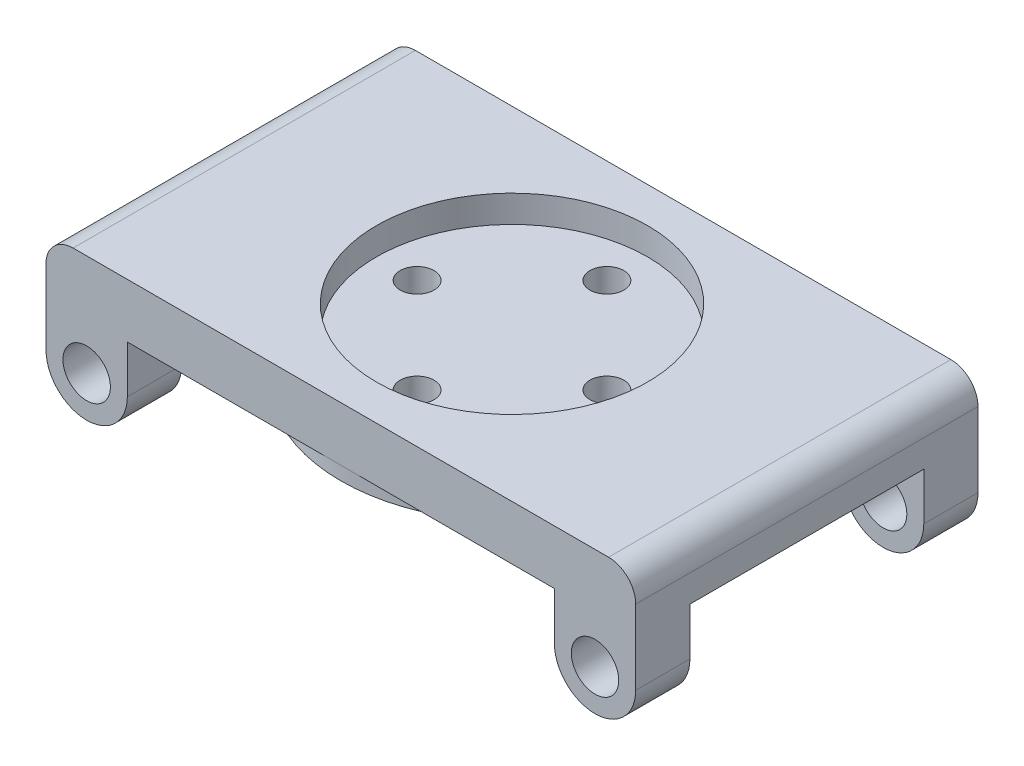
ISO-10303-21;
HEADER;
FILE_DESCRIPTION(('STEP AP214'),'2;1');
FILE_NAME('part.step','',(''),(''),'','','');
FILE_SCHEMA(('AUTOMOTIVE_DESIGN { 1 0 10303 214 1 1 1 1 }'));
ENDSEC;
DATA;
#1=APPLICATION_CONTEXT('core data for automotive mechanical design processes');
#2=APPLICATION_PROTOCOL_DEFINITION('international standard','automotive_design',2000,#1);
#3=PRODUCT_CONTEXT('',#1,'mechanical');
#4=PRODUCT('Part','Part','',(#3));
#5=PRODUCT_RELATED_PRODUCT_CATEGORY('part','',(#4));
#6=PRODUCT_DEFINITION_FORMATION('','',#4);
#7=PRODUCT_DEFINITION_CONTEXT('part definition',#1,'design');
#8=PRODUCT_DEFINITION('design','',#6,#7);
#9=PRODUCT_DEFINITION_SHAPE('','',#8);
#10=(LENGTH_UNIT() NAMED_UNIT(*) SI_UNIT(.MILLI.,.METRE.));
#11=(NAMED_UNIT(*) PLANE_ANGLE_UNIT() SI_UNIT($,.RADIAN.));
#12=(NAMED_UNIT(*) SI_UNIT($,.STERADIAN.) SOLID_ANGLE_UNIT());
#13=UNCERTAINTY_MEASURE_WITH_UNIT(LENGTH_MEASURE(1.E-05),#10,'distance_accuracy_value','');
#14=(GEOMETRIC_REPRESENTATION_CONTEXT(3) GLOBAL_UNCERTAINTY_ASSIGNED_CONTEXT((#13)) GLOBAL_UNIT_ASSIGNED_CONTEXT((#10,
#11,#12)) REPRESENTATION_CONTEXT('',''));
#15=CARTESIAN_POINT('',(0.,0.,0.));
#16=DIRECTION('',(0.,0.,1.));
#17=DIRECTION('',(1.,0.,0.));
#18=AXIS2_PLACEMENT_3D('',#15,#16,#17);
#19=CARTESIAN_POINT('',(0.,0.,0.));
#20=DIRECTION('',(0.,-1.,0.));
#21=DIRECTION('',(0.,0.,-1.));
#22=AXIS2_PLACEMENT_3D('',#19,#20,#21);
#23=PLANE('',#22);
#24=DIRECTION('',(1.,0.,0.));
#25=VECTOR('',#24,1.);
#26=CARTESIAN_POINT('',(0.,0.,-8.625));
#27=LINE('',#26,#25);
#28=CARTESIAN_POINT('',(-21.75,0.,-8.625));
#29=VERTEX_POINT('',#28);
#30=CARTESIAN_POINT('',(-15.75,0.,-8.625));
#31=VERTEX_POINT('',#30);
#32=EDGE_CURVE('E248',#29,#31,#27,.T.);
#33=ORIENTED_EDGE('',*,*,#32,.T.);
#34=DIRECTION('',(0.,0.,-1.));
#35=VECTOR('',#34,1.);
#36=CARTESIAN_POINT('',(-15.75,0.,-8.625));
#37=LINE('',#36,#35);
#38=CARTESIAN_POINT('',(-15.75,0.,-12.625));
#39=VERTEX_POINT('',#38);
#40=EDGE_CURVE('E258',#31,#39,#37,.T.);
#41=ORIENTED_EDGE('',*,*,#40,.T.);
#42=DIRECTION('',(-1.,0.,0.));
#43=VECTOR('',#42,1.);
#44=CARTESIAN_POINT('',(-21.75,0.,-12.625));
#45=LINE('',#44,#43);
#46=CARTESIAN_POINT('',(0.,0.,-12.625));
#47=VERTEX_POINT('',#46);
#48=EDGE_CURVE('E422',#47,#39,#45,.T.);
#49=ORIENTED_EDGE('',*,*,#48,.F.);
#50=CARTESIAN_POINT('',(0.,0.,0.));
#51=DIRECTION('',(0.,-1.,0.));
#52=DIRECTION('',(0.,0.,-1.));
#53=AXIS2_PLACEMENT_3D('',#50,#51,#52);
#54=CIRCLE('',#53,12.625);
#55=CARTESIAN_POINT('',(0.,0.,12.625));
#56=VERTEX_POINT('',#55);
#57=EDGE_CURVE('E400',#56,#47,#54,.T.);
#58=ORIENTED_EDGE('',*,*,#57,.F.);
#59=DIRECTION('',(1.,0.,0.));
#60=VECTOR('',#59,1.);
#61=CARTESIAN_POINT('',(-21.75,0.,12.625));
#62=LINE('',#61,#60);
#63=CARTESIAN_POINT('',(-15.75,0.,12.625));
#64=VERTEX_POINT('',#63);
#65=EDGE_CURVE('E414',#64,#56,#62,.T.);
#66=ORIENTED_EDGE('',*,*,#65,.F.);
#67=DIRECTION('',(0.,0.,1.));
#68=VECTOR('',#67,1.);
#69=CARTESIAN_POINT('',(-15.75,0.,8.625));
#70=LINE('',#69,#68);
#71=CARTESIAN_POINT('',(-15.75,0.,8.625));
#72=VERTEX_POINT('',#71);
#73=EDGE_CURVE('E349',#72,#64,#70,.T.);
#74=ORIENTED_EDGE('',*,*,#73,.F.);
#75=DIRECTION('',(1.,0.,0.));
#76=VECTOR('',#75,1.);
#77=CARTESIAN_POINT('',(0.,0.,8.625));
#78=LINE('',#77,#76);
#79=CARTESIAN_POINT('',(-21.75,0.,8.625));
#80=VERTEX_POINT('',#79);
#81=EDGE_CURVE('E336',#80,#72,#78,.T.);
#82=ORIENTED_EDGE('',*,*,#81,.F.);
#83=DIRECTION('',(0.,0.,1.));
#84=VECTOR('',#83,1.);
#85=CARTESIAN_POINT('',(-21.75,0.,12.625));
#86=LINE('',#85,#84);
#87=EDGE_CURVE('E426',#29,#80,#86,.T.);
#88=ORIENTED_EDGE('',*,*,#87,.F.);
#89=EDGE_LOOP('',(#33,#41,#49,#58,#66,#74,#82,#88));
#90=FACE_BOUND('',#89,.T.);
#91=ADVANCED_FACE('F53',(#90),#23,.T.);
#92=DIRECTION('',(0.,0.,-1.));
#93=VECTOR('',#92,1.);
#94=CARTESIAN_POINT('',(15.75,0.,-8.625));
#95=LINE('',#94,#93);
#96=CARTESIAN_POINT('',(15.75,0.,-8.625));
#97=VERTEX_POINT('',#96);
#98=CARTESIAN_POINT('',(15.75,0.,-12.625));
#99=VERTEX_POINT('',#98);
#100=EDGE_CURVE('E197',#97,#99,#95,.T.);
#101=ORIENTED_EDGE('',*,*,#100,.F.);
#102=DIRECTION('',(1.,0.,0.));
#103=VECTOR('',#102,1.);
#104=CARTESIAN_POINT('',(0.,0.,-8.625));
#105=LINE('',#104,#103);
#106=CARTESIAN_POINT('',(21.75,0.,-8.625));
#107=VERTEX_POINT('',#106);
#108=EDGE_CURVE('E207',#97,#107,#105,.T.);
#109=ORIENTED_EDGE('',*,*,#108,.T.);
#110=DIRECTION('',(0.,0.,-1.));
#111=VECTOR('',#110,1.);
#112=CARTESIAN_POINT('',(21.75,0.,12.625));
#113=LINE('',#112,#111);
#114=CARTESIAN_POINT('',(21.75,0.,8.625));
#115=VERTEX_POINT('',#114);
#116=EDGE_CURVE('E405',#115,#107,#113,.T.);
#117=ORIENTED_EDGE('',*,*,#116,.F.);
#118=DIRECTION('',(1.,0.,0.));
#119=VECTOR('',#118,1.);
#120=CARTESIAN_POINT('',(0.,0.,8.625));
#121=LINE('',#120,#119);
#122=CARTESIAN_POINT('',(15.75,0.,8.625));
#123=VERTEX_POINT('',#122);
#124=EDGE_CURVE('E287',#123,#115,#121,.T.);
#125=ORIENTED_EDGE('',*,*,#124,.F.);
#126=DIRECTION('',(0.,0.,1.));
#127=VECTOR('',#126,1.);
#128=CARTESIAN_POINT('',(15.75,0.,8.625));
#129=LINE('',#128,#127);
#130=CARTESIAN_POINT('',(15.75,0.,12.625));
#131=VERTEX_POINT('',#130);
#132=EDGE_CURVE('E312',#123,#131,#129,.T.);
#133=ORIENTED_EDGE('',*,*,#132,.T.);
#134=EDGE_CURVE('E429',#56,#131,#62,.T.);
#135=ORIENTED_EDGE('',*,*,#134,.F.);
#136=EDGE_CURVE('E391',#47,#56,#54,.T.);
#137=ORIENTED_EDGE('',*,*,#136,.F.);
#138=EDGE_CURVE('E423',#99,#47,#45,.T.);
#139=ORIENTED_EDGE('',*,*,#138,.F.);
#140=EDGE_LOOP('',(#101,#109,#117,#125,#133,#135,#137,#139));
#141=FACE_BOUND('',#140,.T.);
#142=ADVANCED_FACE('F482',(#141),#23,.T.);
#143=CARTESIAN_POINT('',(21.75,4.,12.625));
#144=DIRECTION('',(-1.,0.,0.));
#145=DIRECTION('',(0.,0.,1.));
#146=AXIS2_PLACEMENT_3D('',#143,#144,#145);
#147=PLANE('',#146);
#148=DIRECTION('',(0.,-1.,0.));
#149=VECTOR('',#148,1.);
#150=CARTESIAN_POINT('',(21.75,4.,-12.625));
#151=LINE('',#150,#149);
#152=CARTESIAN_POINT('',(21.75,2.,-12.625));
#153=VERTEX_POINT('',#152);
#154=CARTESIAN_POINT('',(21.75,-3.5,-12.625));
#155=VERTEX_POINT('',#154);
#156=EDGE_CURVE('E440',#153,#155,#151,.T.);
#157=ORIENTED_EDGE('',*,*,#156,.F.);
#158=DIRECTION('',(0.,0.,-1.));
#159=VECTOR('',#158,1.);
#160=CARTESIAN_POINT('',(21.75,2.,12.625));
#161=LINE('',#160,#159);
#162=CARTESIAN_POINT('',(21.75,2.,12.625));
#163=VERTEX_POINT('',#162);
#164=EDGE_CURVE('E77',#153,#163,#161,.F.);
#165=ORIENTED_EDGE('',*,*,#164,.T.);
#166=DIRECTION('',(0.,-1.,0.));
#167=VECTOR('',#166,1.);
#168=CARTESIAN_POINT('',(21.75,4.,12.625));
#169=LINE('',#168,#167);
#170=CARTESIAN_POINT('',(21.75,-3.5,12.625));
#171=VERTEX_POINT('',#170);
#172=EDGE_CURVE('E418',#163,#171,#169,.T.);
#173=ORIENTED_EDGE('',*,*,#172,.T.);
#174=DIRECTION('',(0.,0.,1.));
#175=VECTOR('',#174,1.);
#176=CARTESIAN_POINT('',(21.75,-3.5,8.625));
#177=LINE('',#176,#175);
#178=CARTESIAN_POINT('',(21.75,-3.5,8.625));
#179=VERTEX_POINT('',#178);
#180=EDGE_CURVE('E297',#179,#171,#177,.T.);
#181=ORIENTED_EDGE('',*,*,#180,.F.);
#182=DIRECTION('',(0.,-1.,0.));
#183=VECTOR('',#182,1.);
#184=CARTESIAN_POINT('',(21.75,0.,8.625));
#185=LINE('',#184,#183);
#186=EDGE_CURVE('E283',#115,#179,#185,.T.);
#187=ORIENTED_EDGE('',*,*,#186,.F.);
#188=ORIENTED_EDGE('',*,*,#116,.T.);
#189=DIRECTION('',(0.,-1.,0.));
#190=VECTOR('',#189,1.);
#191=CARTESIAN_POINT('',(21.75,0.,-8.625));
#192=LINE('',#191,#190);
#193=CARTESIAN_POINT('',(21.75,-3.5,-8.625));
#194=VERTEX_POINT('',#193);
#195=EDGE_CURVE('E223',#107,#194,#192,.T.);
#196=ORIENTED_EDGE('',*,*,#195,.T.);
#197=DIRECTION('',(0.,0.,-1.));
#198=VECTOR('',#197,1.);
#199=CARTESIAN_POINT('',(21.75,-3.5,-8.625));
#200=LINE('',#199,#198);
#201=EDGE_CURVE('E212',#194,#155,#200,.T.);
#202=ORIENTED_EDGE('',*,*,#201,.T.);
#203=EDGE_LOOP('',(#157,#165,#173,#181,#187,#188,#196,#202));
#204=FACE_BOUND('',#203,.T.);
#205=ADVANCED_FACE('F476',(#204),#147,.F.);
#206=CARTESIAN_POINT('',(-21.75,4.,-12.625));
#207=DIRECTION('',(0.,0.,1.));
#208=DIRECTION('',(1.,0.,0.));
#209=AXIS2_PLACEMENT_3D('',#206,#207,#208);
#210=PLANE('',#209);
#211=DIRECTION('',(-1.,0.,0.));
#212=VECTOR('',#211,1.);
#213=CARTESIAN_POINT('',(-21.75,4.,-12.625));
#214=LINE('',#213,#212);
#215=CARTESIAN_POINT('',(19.75,4.,-12.625));
#216=VERTEX_POINT('',#215);
#217=CARTESIAN_POINT('',(-19.75,4.,-12.625));
#218=VERTEX_POINT('',#217);
#219=EDGE_CURVE('E409',#216,#218,#214,.T.);
#220=ORIENTED_EDGE('',*,*,#219,.F.);
#221=CARTESIAN_POINT('',(19.75,2.,-12.625));
#222=DIRECTION('',(0.,0.,1.));
#223=DIRECTION('',(1.,0.,0.));
#224=AXIS2_PLACEMENT_3D('',#221,#222,#223);
#225=CIRCLE('',#224,2.);
#226=EDGE_CURVE('E454',#216,#153,#225,.F.);
#227=ORIENTED_EDGE('',*,*,#226,.T.);
#228=ORIENTED_EDGE('',*,*,#156,.T.);
#229=CARTESIAN_POINT('',(18.75,-3.5,-12.625));
#230=DIRECTION('',(0.,0.,1.));
#231=DIRECTION('',(1.,0.,0.));
#232=AXIS2_PLACEMENT_3D('',#229,#230,#231);
#233=CIRCLE('',#232,3.);
#234=CARTESIAN_POINT('',(15.75,-3.5,-12.625));
#235=VERTEX_POINT('',#234);
#236=EDGE_CURVE('E229',#155,#235,#233,.F.);
#237=ORIENTED_EDGE('',*,*,#236,.T.);
#238=DIRECTION('',(0.,1.,0.));
#239=VECTOR('',#238,1.);
#240=CARTESIAN_POINT('',(15.75,0.,-12.625));
#241=LINE('',#240,#239);
#242=EDGE_CURVE('E191',#235,#99,#241,.T.);
#243=ORIENTED_EDGE('',*,*,#242,.T.);
#244=ORIENTED_EDGE('',*,*,#138,.T.);
#245=ORIENTED_EDGE('',*,*,#48,.T.);
#246=DIRECTION('',(0.,1.,0.));
#247=VECTOR('',#246,1.);
#248=CARTESIAN_POINT('',(-15.75,0.,-12.625));
#249=LINE('',#248,#247);
#250=CARTESIAN_POINT('',(-15.75,-3.5,-12.625));
#251=VERTEX_POINT('',#250);
#252=EDGE_CURVE('E262',#251,#39,#249,.T.);
#253=ORIENTED_EDGE('',*,*,#252,.F.);
#254=CARTESIAN_POINT('',(-18.75,-3.5,-12.625));
#255=DIRECTION('',(0.,0.,1.));
#256=DIRECTION('',(1.,0.,0.));
#257=AXIS2_PLACEMENT_3D('',#254,#255,#256);
#258=CIRCLE('',#257,3.);
#259=CARTESIAN_POINT('',(-21.75,-3.5,-12.625));
#260=VERTEX_POINT('',#259);
#261=EDGE_CURVE('E244',#260,#251,#258,.T.);
#262=ORIENTED_EDGE('',*,*,#261,.F.);
#263=DIRECTION('',(0.,-1.,0.));
#264=VECTOR('',#263,1.);
#265=CARTESIAN_POINT('',(-21.75,4.,-12.625));
#266=LINE('',#265,#264);
#267=CARTESIAN_POINT('',(-21.75,2.,-12.625));
#268=VERTEX_POINT('',#267);
#269=EDGE_CURVE('E437',#268,#260,#266,.T.);
#270=ORIENTED_EDGE('',*,*,#269,.F.);
#271=CARTESIAN_POINT('',(-19.75,2.,-12.625));
#272=DIRECTION('',(0.,0.,1.));
#273=DIRECTION('',(1.,0.,0.));
#274=AXIS2_PLACEMENT_3D('',#271,#272,#273);
#275=CIRCLE('',#274,2.);
#276=EDGE_CURVE('E451',#268,#218,#275,.F.);
#277=ORIENTED_EDGE('',*,*,#276,.T.);
#278=EDGE_LOOP('',(#220,#227,#228,#237,#243,#244,#245,#253,#262,#270,#277));
#279=FACE_BOUND('',#278,.T.);
#280=CARTESIAN_POINT('',(-18.75,-3.5,-12.625));
#281=DIRECTION('',(0.,0.,1.));
#282=DIRECTION('',(1.,0.,0.));
#283=AXIS2_PLACEMENT_3D('',#280,#281,#282);
#284=CIRCLE('',#283,1.75);
#285=CARTESIAN_POINT('',(-17.,-3.5,-12.625));
#286=VERTEX_POINT('',#285);
#287=EDGE_CURVE('E236',#286,#286,#284,.T.);
#288=ORIENTED_EDGE('',*,*,#287,.T.);
#289=EDGE_LOOP('',(#288));
#290=FACE_BOUND('',#289,.T.);
#291=CARTESIAN_POINT('',(18.75,-3.5,-12.625));
#292=DIRECTION('',(0.,0.,1.));
#293=DIRECTION('',(1.,0.,0.));
#294=AXIS2_PLACEMENT_3D('',#291,#292,#293);
#295=CIRCLE('',#294,1.75);
#296=CARTESIAN_POINT('',(20.5,-3.5,-12.625));
#297=VERTEX_POINT('',#296);
#298=EDGE_CURVE('E214',#297,#297,#295,.F.);
#299=ORIENTED_EDGE('',*,*,#298,.F.);
#300=EDGE_LOOP('',(#299));
#301=FACE_BOUND('',#300,.T.);
#302=ADVANCED_FACE('F474',(#279,#290,#301),#210,.F.);
#303=CARTESIAN_POINT('',(-21.75,4.,12.625));
#304=DIRECTION('',(1.,0.,0.));
#305=DIRECTION('',(0.,0.,-1.));
#306=AXIS2_PLACEMENT_3D('',#303,#304,#305);
#307=PLANE('',#306);
#308=DIRECTION('',(0.,-1.,0.));
#309=VECTOR('',#308,1.);
#310=CARTESIAN_POINT('',(-21.75,4.,12.625));
#311=LINE('',#310,#309);
#312=CARTESIAN_POINT('',(-21.75,2.,12.625));
#313=VERTEX_POINT('',#312);
#314=CARTESIAN_POINT('',(-21.75,-3.5,12.625));
#315=VERTEX_POINT('',#314);
#316=EDGE_CURVE('E434',#313,#315,#311,.T.);
#317=ORIENTED_EDGE('',*,*,#316,.F.);
#318=DIRECTION('',(0.,0.,1.));
#319=VECTOR('',#318,1.);
#320=CARTESIAN_POINT('',(-21.75,2.,12.625));
#321=LINE('',#320,#319);
#322=EDGE_CURVE('E11',#313,#268,#321,.F.);
#323=ORIENTED_EDGE('',*,*,#322,.T.);
#324=ORIENTED_EDGE('',*,*,#269,.T.);
#325=DIRECTION('',(0.,0.,-1.));
#326=VECTOR('',#325,1.);
#327=CARTESIAN_POINT('',(-21.75,-3.5,-8.625));
#328=LINE('',#327,#326);
#329=CARTESIAN_POINT('',(-21.75,-3.5,-8.625));
#330=VERTEX_POINT('',#329);
#331=EDGE_CURVE('E267',#330,#260,#328,.T.);
#332=ORIENTED_EDGE('',*,*,#331,.F.);
#333=DIRECTION('',(0.,-1.,0.));
#334=VECTOR('',#333,1.);
#335=CARTESIAN_POINT('',(-21.75,0.,-8.625));
#336=LINE('',#335,#334);
#337=EDGE_CURVE('E243',#29,#330,#336,.T.);
#338=ORIENTED_EDGE('',*,*,#337,.F.);
#339=ORIENTED_EDGE('',*,*,#87,.T.);
#340=DIRECTION('',(0.,-1.,0.));
#341=VECTOR('',#340,1.);
#342=CARTESIAN_POINT('',(-21.75,0.,8.625));
#343=LINE('',#342,#341);
#344=CARTESIAN_POINT('',(-21.75,-3.5,8.625));
#345=VERTEX_POINT('',#344);
#346=EDGE_CURVE('E323',#80,#345,#343,.T.);
#347=ORIENTED_EDGE('',*,*,#346,.T.);
#348=DIRECTION('',(0.,0.,1.));
#349=VECTOR('',#348,1.);
#350=CARTESIAN_POINT('',(-21.75,-3.5,8.625));
#351=LINE('',#350,#349);
#352=EDGE_CURVE('E339',#345,#315,#351,.T.);
#353=ORIENTED_EDGE('',*,*,#352,.T.);
#354=EDGE_LOOP('',(#317,#323,#324,#332,#338,#339,#347,#353));
#355=FACE_BOUND('',#354,.T.);
#356=ADVANCED_FACE('F586',(#355),#307,.F.);
#357=CARTESIAN_POINT('',(-21.75,4.,12.625));
#358=DIRECTION('',(0.,0.,-1.));
#359=DIRECTION('',(-1.,0.,0.));
#360=AXIS2_PLACEMENT_3D('',#357,#358,#359);
#361=PLANE('',#360);
#362=ORIENTED_EDGE('',*,*,#172,.F.);
#363=CARTESIAN_POINT('',(19.75,2.,12.625));
#364=DIRECTION('',(0.,0.,-1.));
#365=DIRECTION('',(-1.,0.,0.));
#366=AXIS2_PLACEMENT_3D('',#363,#364,#365);
#367=CIRCLE('',#366,2.);
#368=CARTESIAN_POINT('',(19.75,4.,12.625));
#369=VERTEX_POINT('',#368);
#370=EDGE_CURVE('E62',#163,#369,#367,.F.);
#371=ORIENTED_EDGE('',*,*,#370,.T.);
#372=DIRECTION('',(1.,0.,0.));
#373=VECTOR('',#372,1.);
#374=CARTESIAN_POINT('',(-21.75,4.,12.625));
#375=LINE('',#374,#373);
#376=CARTESIAN_POINT('',(-19.75,4.,12.625));
#377=VERTEX_POINT('',#376);
#378=EDGE_CURVE('E413',#377,#369,#375,.T.);
#379=ORIENTED_EDGE('',*,*,#378,.F.);
#380=CARTESIAN_POINT('',(-19.75,2.,12.625));
#381=DIRECTION('',(0.,0.,-1.));
#382=DIRECTION('',(-1.,0.,0.));
#383=AXIS2_PLACEMENT_3D('',#380,#381,#382);
#384=CIRCLE('',#383,2.);
#385=EDGE_CURVE('E69',#377,#313,#384,.F.);
#386=ORIENTED_EDGE('',*,*,#385,.T.);
#387=ORIENTED_EDGE('',*,*,#316,.T.);
#388=CARTESIAN_POINT('',(-18.75,-3.5,12.625));
#389=DIRECTION('',(0.,0.,1.));
#390=DIRECTION('',(1.,0.,0.));
#391=AXIS2_PLACEMENT_3D('',#388,#389,#390);
#392=CIRCLE('',#391,3.);
#393=CARTESIAN_POINT('',(-15.75,-3.5,12.625));
#394=VERTEX_POINT('',#393);
#395=EDGE_CURVE('E343',#315,#394,#392,.T.);
#396=ORIENTED_EDGE('',*,*,#395,.T.);
#397=DIRECTION('',(0.,1.,0.));
#398=VECTOR('',#397,1.);
#399=CARTESIAN_POINT('',(-15.75,0.,12.625));
#400=LINE('',#399,#398);
#401=EDGE_CURVE('E324',#394,#64,#400,.T.);
#402=ORIENTED_EDGE('',*,*,#401,.T.);
#403=ORIENTED_EDGE('',*,*,#65,.T.);
#404=ORIENTED_EDGE('',*,*,#134,.T.);
#405=DIRECTION('',(0.,1.,0.));
#406=VECTOR('',#405,1.);
#407=CARTESIAN_POINT('',(15.75,0.,12.625));
#408=LINE('',#407,#406);
#409=CARTESIAN_POINT('',(15.75,-3.5,12.625));
#410=VERTEX_POINT('',#409);
#411=EDGE_CURVE('E301',#410,#131,#408,.T.);
#412=ORIENTED_EDGE('',*,*,#411,.F.);
#413=CARTESIAN_POINT('',(18.75,-3.5,12.625));
#414=DIRECTION('',(0.,0.,1.));
#415=DIRECTION('',(1.,0.,0.));
#416=AXIS2_PLACEMENT_3D('',#413,#414,#415);
#417=CIRCLE('',#416,3.);
#418=EDGE_CURVE('E271',#171,#410,#417,.F.);
#419=ORIENTED_EDGE('',*,*,#418,.F.);
#420=EDGE_LOOP('',(#362,#371,#379,#386,#387,#396,#402,#403,#404,#412,#419));
#421=FACE_BOUND('',#420,.T.);
#422=CARTESIAN_POINT('',(-18.75,-3.5,12.625));
#423=DIRECTION('',(0.,0.,1.));
#424=DIRECTION('',(1.,0.,0.));
#425=AXIS2_PLACEMENT_3D('',#422,#423,#424);
#426=CIRCLE('',#425,1.75);
#427=CARTESIAN_POINT('',(-17.,-3.5,12.625));
#428=VERTEX_POINT('',#427);
#429=EDGE_CURVE('E311',#428,#428,#426,.T.);
#430=ORIENTED_EDGE('',*,*,#429,.F.);
#431=EDGE_LOOP('',(#430));
#432=FACE_BOUND('',#431,.T.);
#433=CARTESIAN_POINT('',(18.75,-3.5,12.625));
#434=DIRECTION('',(0.,0.,1.));
#435=DIRECTION('',(1.,0.,0.));
#436=AXIS2_PLACEMENT_3D('',#433,#434,#435);
#437=CIRCLE('',#436,1.75);
#438=CARTESIAN_POINT('',(20.5,-3.5,12.625));
#439=VERTEX_POINT('',#438);
#440=EDGE_CURVE('E284',#439,#439,#437,.F.);
#441=ORIENTED_EDGE('',*,*,#440,.T.);
#442=EDGE_LOOP('',(#441));
#443=FACE_BOUND('',#442,.T.);
#444=ADVANCED_FACE('F463',(#421,#432,#443),#361,.F.);
#445=CARTESIAN_POINT('',(0.,4.,0.));
#446=DIRECTION('',(0.,-1.,0.));
#447=DIRECTION('',(0.,0.,-1.));
#448=AXIS2_PLACEMENT_3D('',#445,#446,#447);
#449=PLANE('',#448);
#450=CARTESIAN_POINT('',(0.,4.,0.));
#451=DIRECTION('',(0.,1.,0.));
#452=DIRECTION('',(0.,0.,1.));
#453=AXIS2_PLACEMENT_3D('',#450,#451,#452);
#454=CIRCLE('',#453,10.);
#455=CARTESIAN_POINT('',(0.,4.,10.));
#456=VERTEX_POINT('',#455);
#457=EDGE_CURVE('E396',#456,#456,#454,.T.);
#458=ORIENTED_EDGE('',*,*,#457,.F.);
#459=EDGE_LOOP('',(#458));
#460=FACE_BOUND('',#459,.T.);
#461=ORIENTED_EDGE('',*,*,#378,.T.);
#462=DIRECTION('',(0.,0.,-1.));
#463=VECTOR('',#462,1.);
#464=CARTESIAN_POINT('',(19.75,4.,0.));
#465=LINE('',#464,#463);
#466=EDGE_CURVE('E447',#369,#216,#465,.T.);
#467=ORIENTED_EDGE('',*,*,#466,.T.);
#468=ORIENTED_EDGE('',*,*,#219,.T.);
#469=DIRECTION('',(0.,0.,1.));
#470=VECTOR('',#469,1.);
#471=CARTESIAN_POINT('',(-19.75,4.,0.));
#472=LINE('',#471,#470);
#473=EDGE_CURVE('E443',#218,#377,#472,.T.);
#474=ORIENTED_EDGE('',*,*,#473,.T.);
#475=EDGE_LOOP('',(#461,#467,#468,#474));
#476=FACE_BOUND('',#475,.T.);
#477=ADVANCED_FACE('F469',(#460,#476),#449,.F.);
#478=CARTESIAN_POINT('',(0.,2.,0.));
#479=DIRECTION('',(0.,1.,0.));
#480=DIRECTION('',(0.,0.,1.));
#481=AXIS2_PLACEMENT_3D('',#478,#479,#480);
#482=CYLINDRICAL_SURFACE('',#481,10.);
#483=CARTESIAN_POINT('',(0.,2.,0.));
#484=DIRECTION('',(0.,1.,0.));
#485=DIRECTION('',(0.,0.,1.));
#486=AXIS2_PLACEMENT_3D('',#483,#484,#485);
#487=CIRCLE('',#486,10.);
#488=CARTESIAN_POINT('',(0.,2.,10.));
#489=VERTEX_POINT('',#488);
#490=EDGE_CURVE('E401',#489,#489,#487,.T.);
#491=ORIENTED_EDGE('',*,*,#490,.F.);
#492=EDGE_LOOP('',(#491));
#493=FACE_BOUND('',#492,.T.);
#494=ORIENTED_EDGE('',*,*,#457,.T.);
#495=EDGE_LOOP('',(#494));
#496=FACE_BOUND('',#495,.T.);
#497=ADVANCED_FACE('F626',(#493,#496),#482,.F.);
#498=CARTESIAN_POINT('',(0.,2.,0.));
#499=DIRECTION('',(0.,1.,0.));
#500=DIRECTION('',(0.,0.,1.));
#501=AXIS2_PLACEMENT_3D('',#498,#499,#500);
#502=PLANE('',#501);
#503=CARTESIAN_POINT('',(0.,2.,-7.));
#504=DIRECTION('',(0.,1.,0.));
#505=DIRECTION('',(0.,0.,1.));
#506=AXIS2_PLACEMENT_3D('',#503,#504,#505);
#507=CIRCLE('',#506,1.25);
#508=CARTESIAN_POINT('',(0.,2.,-5.75));
#509=VERTEX_POINT('',#508);
#510=EDGE_CURVE('E387',#509,#509,#507,.T.);
#511=ORIENTED_EDGE('',*,*,#510,.F.);
#512=EDGE_LOOP('',(#511));
#513=FACE_BOUND('',#512,.T.);
#514=CARTESIAN_POINT('',(7.,2.,0.));
#515=DIRECTION('',(0.,1.,0.));
#516=DIRECTION('',(0.,0.,1.));
#517=AXIS2_PLACEMENT_3D('',#514,#515,#516);
#518=CIRCLE('',#517,1.25);
#519=CARTESIAN_POINT('',(7.,2.,1.25000000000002));
#520=VERTEX_POINT('',#519);
#521=EDGE_CURVE('E383',#520,#520,#518,.T.);
#522=ORIENTED_EDGE('',*,*,#521,.F.);
#523=EDGE_LOOP('',(#522));
#524=FACE_BOUND('',#523,.T.);
#525=CARTESIAN_POINT('',(0.,2.,7.));
#526=DIRECTION('',(0.,1.,0.));
#527=DIRECTION('',(0.,0.,1.));
#528=AXIS2_PLACEMENT_3D('',#525,#526,#527);
#529=CIRCLE('',#528,1.25);
#530=CARTESIAN_POINT('',(0.,2.,8.25));
#531=VERTEX_POINT('',#530);
#532=EDGE_CURVE('E379',#531,#531,#529,.T.);
#533=ORIENTED_EDGE('',*,*,#532,.F.);
#534=EDGE_LOOP('',(#533));
#535=FACE_BOUND('',#534,.T.);
#536=CARTESIAN_POINT('',(-7.,2.,0.));
#537=DIRECTION('',(0.,1.,0.));
#538=DIRECTION('',(0.,0.,1.));
#539=AXIS2_PLACEMENT_3D('',#536,#537,#538);
#540=CIRCLE('',#539,1.25);
#541=CARTESIAN_POINT('',(-7.,2.,1.24999999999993));
#542=VERTEX_POINT('',#541);
#543=EDGE_CURVE('E364',#542,#542,#540,.T.);
#544=ORIENTED_EDGE('',*,*,#543,.F.);
#545=EDGE_LOOP('',(#544));
#546=FACE_BOUND('',#545,.T.);
#547=ORIENTED_EDGE('',*,*,#490,.T.);
#548=EDGE_LOOP('',(#547));
#549=FACE_BOUND('',#548,.T.);
#550=ADVANCED_FACE('F638',(#513,#524,#535,#546,#549),#502,.T.);
#551=CARTESIAN_POINT('',(0.,-1.,0.));
#552=DIRECTION('',(0.,1.,0.));
#553=DIRECTION('',(0.,0.,1.));
#554=AXIS2_PLACEMENT_3D('',#551,#552,#553);
#555=CYLINDRICAL_SURFACE('',#554,12.625);
#556=CARTESIAN_POINT('',(0.,-1.,0.));
#557=DIRECTION('',(0.,-1.,0.));
#558=DIRECTION('',(0.,0.,-1.));
#559=AXIS2_PLACEMENT_3D('',#556,#557,#558);
#560=CIRCLE('',#559,12.625);
#561=CARTESIAN_POINT('',(0.,-1.,-12.625));
#562=VERTEX_POINT('',#561);
#563=EDGE_CURVE('E392',#562,#562,#560,.T.);
#564=ORIENTED_EDGE('',*,*,#563,.F.);
#565=EDGE_LOOP('',(#564));
#566=FACE_BOUND('',#565,.T.);
#567=ORIENTED_EDGE('',*,*,#136,.T.);
#568=ORIENTED_EDGE('',*,*,#57,.T.);
#569=EDGE_LOOP('',(#567,#568));
#570=FACE_BOUND('',#569,.T.);
#571=ADVANCED_FACE('F488',(#566,#570),#555,.T.);
#572=CARTESIAN_POINT('',(0.,-1.,0.));
#573=DIRECTION('',(0.,-1.,0.));
#574=DIRECTION('',(0.,0.,-1.));
#575=AXIS2_PLACEMENT_3D('',#572,#573,#574);
#576=PLANE('',#575);
#577=CARTESIAN_POINT('',(0.,-1.,-7.));
#578=DIRECTION('',(0.,1.,0.));
#579=DIRECTION('',(0.,0.,1.));
#580=AXIS2_PLACEMENT_3D('',#577,#578,#579);
#581=CIRCLE('',#580,1.25);
#582=CARTESIAN_POINT('',(0.,-1.,-5.75));
#583=VERTEX_POINT('',#582);
#584=EDGE_CURVE('E360',#583,#583,#581,.T.);
#585=ORIENTED_EDGE('',*,*,#584,.T.);
#586=EDGE_LOOP('',(#585));
#587=FACE_BOUND('',#586,.T.);
#588=CARTESIAN_POINT('',(7.,-1.,0.));
#589=DIRECTION('',(0.,1.,0.));
#590=DIRECTION('',(0.,0.,1.));
#591=AXIS2_PLACEMENT_3D('',#588,#589,#590);
#592=CIRCLE('',#591,1.25);
#593=CARTESIAN_POINT('',(7.,-1.,1.25000000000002));
#594=VERTEX_POINT('',#593);
#595=EDGE_CURVE('E365',#594,#594,#592,.T.);
#596=ORIENTED_EDGE('',*,*,#595,.T.);
#597=EDGE_LOOP('',(#596));
#598=FACE_BOUND('',#597,.T.);
#599=CARTESIAN_POINT('',(0.,-1.,7.));
#600=DIRECTION('',(0.,1.,0.));
#601=DIRECTION('',(0.,0.,1.));
#602=AXIS2_PLACEMENT_3D('',#599,#600,#601);
#603=CIRCLE('',#602,1.25);
#604=CARTESIAN_POINT('',(0.,-1.,8.25));
#605=VERTEX_POINT('',#604);
#606=EDGE_CURVE('E369',#605,#605,#603,.T.);
#607=ORIENTED_EDGE('',*,*,#606,.T.);
#608=EDGE_LOOP('',(#607));
#609=FACE_BOUND('',#608,.T.);
#610=CARTESIAN_POINT('',(-7.,-1.,0.));
#611=DIRECTION('',(0.,1.,0.));
#612=DIRECTION('',(0.,0.,1.));
#613=AXIS2_PLACEMENT_3D('',#610,#611,#612);
#614=CIRCLE('',#613,1.25);
#615=CARTESIAN_POINT('',(-7.,-1.,1.24999999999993));
#616=VERTEX_POINT('',#615);
#617=EDGE_CURVE('E353',#616,#616,#614,.T.);
#618=ORIENTED_EDGE('',*,*,#617,.T.);
#619=EDGE_LOOP('',(#618));
#620=FACE_BOUND('',#619,.T.);
#621=ORIENTED_EDGE('',*,*,#563,.T.);
#622=EDGE_LOOP('',(#621));
#623=FACE_BOUND('',#622,.T.);
#624=ADVANCED_FACE('F645',(#587,#598,#609,#620,#623),#576,.T.);
#625=CARTESIAN_POINT('',(-7.,-1.,0.));
#626=DIRECTION('',(0.,1.,0.));
#627=DIRECTION('',(0.,0.,1.));
#628=AXIS2_PLACEMENT_3D('',#625,#626,#627);
#629=CYLINDRICAL_SURFACE('',#628,1.25);
#630=ORIENTED_EDGE('',*,*,#543,.T.);
#631=EDGE_LOOP('',(#630));
#632=FACE_BOUND('',#631,.T.);
#633=ORIENTED_EDGE('',*,*,#617,.F.);
#634=EDGE_LOOP('',(#633));
#635=FACE_BOUND('',#634,.T.);
#636=ADVANCED_FACE('F649',(#632,#635),#629,.F.);
#637=CARTESIAN_POINT('',(0.,-1.,7.));
#638=DIRECTION('',(0.,1.,0.));
#639=DIRECTION('',(0.,0.,1.));
#640=AXIS2_PLACEMENT_3D('',#637,#638,#639);
#641=CYLINDRICAL_SURFACE('',#640,1.25);
#642=ORIENTED_EDGE('',*,*,#532,.T.);
#643=EDGE_LOOP('',(#642));
#644=FACE_BOUND('',#643,.T.);
#645=ORIENTED_EDGE('',*,*,#606,.F.);
#646=EDGE_LOOP('',(#645));
#647=FACE_BOUND('',#646,.T.);
#648=ADVANCED_FACE('F653',(#644,#647),#641,.F.);
#649=CARTESIAN_POINT('',(7.,-1.,0.));
#650=DIRECTION('',(0.,1.,0.));
#651=DIRECTION('',(0.,0.,1.));
#652=AXIS2_PLACEMENT_3D('',#649,#650,#651);
#653=CYLINDRICAL_SURFACE('',#652,1.25);
#654=ORIENTED_EDGE('',*,*,#521,.T.);
#655=EDGE_LOOP('',(#654));
#656=FACE_BOUND('',#655,.T.);
#657=ORIENTED_EDGE('',*,*,#595,.F.);
#658=EDGE_LOOP('',(#657));
#659=FACE_BOUND('',#658,.T.);
#660=ADVANCED_FACE('F657',(#656,#659),#653,.F.);
#661=CARTESIAN_POINT('',(0.,-1.,-7.));
#662=DIRECTION('',(0.,1.,0.));
#663=DIRECTION('',(0.,0.,1.));
#664=AXIS2_PLACEMENT_3D('',#661,#662,#663);
#665=CYLINDRICAL_SURFACE('',#664,1.25);
#666=ORIENTED_EDGE('',*,*,#510,.T.);
#667=EDGE_LOOP('',(#666));
#668=FACE_BOUND('',#667,.T.);
#669=ORIENTED_EDGE('',*,*,#584,.F.);
#670=EDGE_LOOP('',(#669));
#671=FACE_BOUND('',#670,.T.);
#672=ADVANCED_FACE('F661',(#668,#671),#665,.F.);
#673=CARTESIAN_POINT('',(-15.75,0.,8.625));
#674=DIRECTION('',(1.,0.,0.));
#675=DIRECTION('',(0.,1.,0.));
#676=AXIS2_PLACEMENT_3D('',#673,#674,#675);
#677=PLANE('',#676);
#678=ORIENTED_EDGE('',*,*,#401,.F.);
#679=DIRECTION('',(0.,0.,1.));
#680=VECTOR('',#679,1.);
#681=CARTESIAN_POINT('',(-15.75,-3.5,8.625));
#682=LINE('',#681,#680);
#683=CARTESIAN_POINT('',(-15.75,-3.5,8.625));
#684=VERTEX_POINT('',#683);
#685=EDGE_CURVE('E354',#684,#394,#682,.T.);
#686=ORIENTED_EDGE('',*,*,#685,.F.);
#687=DIRECTION('',(0.,1.,0.));
#688=VECTOR('',#687,1.);
#689=CARTESIAN_POINT('',(-15.75,0.,8.625));
#690=LINE('',#689,#688);
#691=EDGE_CURVE('E332',#684,#72,#690,.T.);
#692=ORIENTED_EDGE('',*,*,#691,.T.);
#693=ORIENTED_EDGE('',*,*,#73,.T.);
#694=EDGE_LOOP('',(#678,#686,#692,#693));
#695=FACE_BOUND('',#694,.T.);
#696=ADVANCED_FACE('F594',(#695),#677,.T.);
#697=CARTESIAN_POINT('',(-18.75,-3.5,8.625));
#698=DIRECTION('',(0.,0.,1.));
#699=DIRECTION('',(1.,0.,0.));
#700=AXIS2_PLACEMENT_3D('',#697,#698,#699);
#701=CYLINDRICAL_SURFACE('',#700,1.75);
#702=CARTESIAN_POINT('',(-18.75,-3.5,8.625));
#703=DIRECTION('',(0.,0.,1.));
#704=DIRECTION('',(1.,0.,0.));
#705=AXIS2_PLACEMENT_3D('',#702,#703,#704);
#706=CIRCLE('',#705,1.75);
#707=CARTESIAN_POINT('',(-17.,-3.5,8.625));
#708=VERTEX_POINT('',#707);
#709=EDGE_CURVE('E319',#708,#708,#706,.T.);
#710=ORIENTED_EDGE('',*,*,#709,.F.);
#711=EDGE_LOOP('',(#710));
#712=FACE_BOUND('',#711,.T.);
#713=ORIENTED_EDGE('',*,*,#429,.T.);
#714=EDGE_LOOP('',(#713));
#715=FACE_BOUND('',#714,.T.);
#716=ADVANCED_FACE('F666',(#712,#715),#701,.F.);
#717=CARTESIAN_POINT('',(-18.75,-3.5,8.625));
#718=DIRECTION('',(0.,0.,1.));
#719=DIRECTION('',(1.,0.,0.));
#720=AXIS2_PLACEMENT_3D('',#717,#718,#719);
#721=CYLINDRICAL_SURFACE('',#720,3.);
#722=ORIENTED_EDGE('',*,*,#395,.F.);
#723=ORIENTED_EDGE('',*,*,#352,.F.);
#724=CARTESIAN_POINT('',(-18.75,-3.5,8.625));
#725=DIRECTION('',(0.,0.,1.));
#726=DIRECTION('',(1.,0.,0.));
#727=AXIS2_PLACEMENT_3D('',#724,#725,#726);
#728=CIRCLE('',#727,3.);
#729=EDGE_CURVE('E328',#345,#684,#728,.T.);
#730=ORIENTED_EDGE('',*,*,#729,.T.);
#731=ORIENTED_EDGE('',*,*,#685,.T.);
#732=EDGE_LOOP('',(#722,#723,#730,#731));
#733=FACE_BOUND('',#732,.T.);
#734=ADVANCED_FACE('F590',(#733),#721,.T.);
#735=CARTESIAN_POINT('',(0.,0.,8.625));
#736=DIRECTION('',(0.,0.,1.));
#737=DIRECTION('',(1.,0.,0.));
#738=AXIS2_PLACEMENT_3D('',#735,#736,#737);
#739=PLANE('',#738);
#740=ORIENTED_EDGE('',*,*,#709,.T.);
#741=EDGE_LOOP('',(#740));
#742=FACE_BOUND('',#741,.T.);
#743=ORIENTED_EDGE('',*,*,#346,.F.);
#744=ORIENTED_EDGE('',*,*,#81,.T.);
#745=ORIENTED_EDGE('',*,*,#691,.F.);
#746=ORIENTED_EDGE('',*,*,#729,.F.);
#747=EDGE_LOOP('',(#743,#744,#745,#746));
#748=FACE_BOUND('',#747,.T.);
#749=ADVANCED_FACE('F672',(#742,#748),#739,.F.);
#750=CARTESIAN_POINT('',(18.75,-3.5,8.625));
#751=DIRECTION('',(0.,0.,1.));
#752=DIRECTION('',(1.,0.,0.));
#753=AXIS2_PLACEMENT_3D('',#750,#751,#752);
#754=CYLINDRICAL_SURFACE('',#753,3.);
#755=ORIENTED_EDGE('',*,*,#418,.T.);
#756=DIRECTION('',(0.,0.,1.));
#757=VECTOR('',#756,1.);
#758=CARTESIAN_POINT('',(15.75,-3.5,8.625));
#759=LINE('',#758,#757);
#760=CARTESIAN_POINT('',(15.75,-3.5,8.625));
#761=VERTEX_POINT('',#760);
#762=EDGE_CURVE('E307',#761,#410,#759,.T.);
#763=ORIENTED_EDGE('',*,*,#762,.F.);
#764=CARTESIAN_POINT('',(18.75,-3.5,8.625));
#765=DIRECTION('',(0.,0.,1.));
#766=DIRECTION('',(1.,0.,0.));
#767=AXIS2_PLACEMENT_3D('',#764,#765,#766);
#768=CIRCLE('',#767,3.);
#769=EDGE_CURVE('E279',#179,#761,#768,.F.);
#770=ORIENTED_EDGE('',*,*,#769,.F.);
#771=ORIENTED_EDGE('',*,*,#180,.T.);
#772=EDGE_LOOP('',(#755,#763,#770,#771));
#773=FACE_BOUND('',#772,.T.);
#774=ADVANCED_FACE('F603',(#773),#754,.T.);
#775=CARTESIAN_POINT('',(15.75,0.,8.625));
#776=DIRECTION('',(1.,0.,0.));
#777=DIRECTION('',(0.,1.,0.));
#778=AXIS2_PLACEMENT_3D('',#775,#776,#777);
#779=PLANE('',#778);
#780=ORIENTED_EDGE('',*,*,#411,.T.);
#781=ORIENTED_EDGE('',*,*,#132,.F.);
#782=DIRECTION('',(0.,1.,0.));
#783=VECTOR('',#782,1.);
#784=CARTESIAN_POINT('',(15.75,0.,8.625));
#785=LINE('',#784,#783);
#786=EDGE_CURVE('E290',#761,#123,#785,.T.);
#787=ORIENTED_EDGE('',*,*,#786,.F.);
#788=ORIENTED_EDGE('',*,*,#762,.T.);
#789=EDGE_LOOP('',(#780,#781,#787,#788));
#790=FACE_BOUND('',#789,.T.);
#791=ADVANCED_FACE('F600',(#790),#779,.F.);
#792=CARTESIAN_POINT('',(18.75,-3.5,8.625));
#793=DIRECTION('',(0.,0.,1.));
#794=DIRECTION('',(1.,0.,0.));
#795=AXIS2_PLACEMENT_3D('',#792,#793,#794);
#796=CYLINDRICAL_SURFACE('',#795,1.75);
#797=CARTESIAN_POINT('',(18.75,-3.5,8.625));
#798=DIRECTION('',(0.,0.,1.));
#799=DIRECTION('',(1.,0.,0.));
#800=AXIS2_PLACEMENT_3D('',#797,#798,#799);
#801=CIRCLE('',#800,1.75);
#802=CARTESIAN_POINT('',(20.5,-3.5,8.625));
#803=VERTEX_POINT('',#802);
#804=EDGE_CURVE('E293',#803,#803,#801,.F.);
#805=ORIENTED_EDGE('',*,*,#804,.T.);
#806=EDGE_LOOP('',(#805));
#807=FACE_BOUND('',#806,.T.);
#808=ORIENTED_EDGE('',*,*,#440,.F.);
#809=EDGE_LOOP('',(#808));
#810=FACE_BOUND('',#809,.T.);
#811=ADVANCED_FACE('F612',(#807,#810),#796,.F.);
#812=CARTESIAN_POINT('',(0.,0.,8.625));
#813=DIRECTION('',(0.,0.,1.));
#814=DIRECTION('',(1.,0.,0.));
#815=AXIS2_PLACEMENT_3D('',#812,#813,#814);
#816=PLANE('',#815);
#817=ORIENTED_EDGE('',*,*,#769,.T.);
#818=ORIENTED_EDGE('',*,*,#786,.T.);
#819=ORIENTED_EDGE('',*,*,#124,.T.);
#820=ORIENTED_EDGE('',*,*,#186,.T.);
#821=EDGE_LOOP('',(#817,#818,#819,#820));
#822=FACE_BOUND('',#821,.T.);
#823=ORIENTED_EDGE('',*,*,#804,.F.);
#824=EDGE_LOOP('',(#823));
#825=FACE_BOUND('',#824,.T.);
#826=ADVANCED_FACE('F609',(#822,#825),#816,.F.);
#827=CARTESIAN_POINT('',(-18.75,-3.5,-8.625));
#828=DIRECTION('',(0.,0.,-1.));
#829=DIRECTION('',(-1.,0.,0.));
#830=AXIS2_PLACEMENT_3D('',#827,#828,#829);
#831=CYLINDRICAL_SURFACE('',#830,3.);
#832=ORIENTED_EDGE('',*,*,#261,.T.);
#833=DIRECTION('',(0.,0.,-1.));
#834=VECTOR('',#833,1.);
#835=CARTESIAN_POINT('',(-15.75,-3.5,-8.625));
#836=LINE('',#835,#834);
#837=CARTESIAN_POINT('',(-15.75,-3.5,-8.625));
#838=VERTEX_POINT('',#837);
#839=EDGE_CURVE('E272',#838,#251,#836,.T.);
#840=ORIENTED_EDGE('',*,*,#839,.F.);
#841=CARTESIAN_POINT('',(-18.75,-3.5,-8.625));
#842=DIRECTION('',(0.,0.,1.));
#843=DIRECTION('',(1.,0.,0.));
#844=AXIS2_PLACEMENT_3D('',#841,#842,#843);
#845=CIRCLE('',#844,3.);
#846=EDGE_CURVE('E255',#330,#838,#845,.T.);
#847=ORIENTED_EDGE('',*,*,#846,.F.);
#848=ORIENTED_EDGE('',*,*,#331,.T.);
#849=EDGE_LOOP('',(#832,#840,#847,#848));
#850=FACE_BOUND('',#849,.T.);
#851=ADVANCED_FACE('F579',(#850),#831,.T.);
#852=CARTESIAN_POINT('',(-15.75,0.,-8.625));
#853=DIRECTION('',(-1.,0.,0.));
#854=DIRECTION('',(0.,-1.,0.));
#855=AXIS2_PLACEMENT_3D('',#852,#853,#854);
#856=PLANE('',#855);
#857=ORIENTED_EDGE('',*,*,#252,.T.);
#858=ORIENTED_EDGE('',*,*,#40,.F.);
#859=DIRECTION('',(0.,1.,0.));
#860=VECTOR('',#859,1.);
#861=CARTESIAN_POINT('',(-15.75,0.,-8.625));
#862=LINE('',#861,#860);
#863=EDGE_CURVE('E252',#838,#31,#862,.T.);
#864=ORIENTED_EDGE('',*,*,#863,.F.);
#865=ORIENTED_EDGE('',*,*,#839,.T.);
#866=EDGE_LOOP('',(#857,#858,#864,#865));
#867=FACE_BOUND('',#866,.T.);
#868=ADVANCED_FACE('F576',(#867),#856,.F.);
#869=CARTESIAN_POINT('',(-18.75,-3.5,-8.625));
#870=DIRECTION('',(0.,0.,-1.));
#871=DIRECTION('',(-1.,0.,0.));
#872=AXIS2_PLACEMENT_3D('',#869,#870,#871);
#873=CYLINDRICAL_SURFACE('',#872,1.75);
#874=CARTESIAN_POINT('',(-18.75,-3.5,-8.625));
#875=DIRECTION('',(0.,0.,1.));
#876=DIRECTION('',(1.,0.,0.));
#877=AXIS2_PLACEMENT_3D('',#874,#875,#876);
#878=CIRCLE('',#877,1.75);
#879=CARTESIAN_POINT('',(-17.,-3.5,-8.625));
#880=VERTEX_POINT('',#879);
#881=EDGE_CURVE('E239',#880,#880,#878,.T.);
#882=ORIENTED_EDGE('',*,*,#881,.T.);
#883=EDGE_LOOP('',(#882));
#884=FACE_BOUND('',#883,.T.);
#885=ORIENTED_EDGE('',*,*,#287,.F.);
#886=EDGE_LOOP('',(#885));
#887=FACE_BOUND('',#886,.T.);
#888=ADVANCED_FACE('F682',(#884,#887),#873,.F.);
#889=CARTESIAN_POINT('',(0.,0.,-8.625));
#890=DIRECTION('',(0.,0.,-1.));
#891=DIRECTION('',(1.,0.,0.));
#892=AXIS2_PLACEMENT_3D('',#889,#890,#891);
#893=PLANE('',#892);
#894=ORIENTED_EDGE('',*,*,#881,.F.);
#895=EDGE_LOOP('',(#894));
#896=FACE_BOUND('',#895,.T.);
#897=ORIENTED_EDGE('',*,*,#337,.T.);
#898=ORIENTED_EDGE('',*,*,#846,.T.);
#899=ORIENTED_EDGE('',*,*,#863,.T.);
#900=ORIENTED_EDGE('',*,*,#32,.F.);
#901=EDGE_LOOP('',(#897,#898,#899,#900));
#902=FACE_BOUND('',#901,.T.);
#903=ADVANCED_FACE('F685',(#896,#902),#893,.F.);
#904=CARTESIAN_POINT('',(18.75,-3.5,-8.625));
#905=DIRECTION('',(0.,0.,-1.));
#906=DIRECTION('',(-1.,0.,0.));
#907=AXIS2_PLACEMENT_3D('',#904,#905,#906);
#908=CYLINDRICAL_SURFACE('',#907,3.);
#909=ORIENTED_EDGE('',*,*,#236,.F.);
#910=ORIENTED_EDGE('',*,*,#201,.F.);
#911=CARTESIAN_POINT('',(18.75,-3.5,-8.625));
#912=DIRECTION('',(0.,0.,1.));
#913=DIRECTION('',(1.,0.,0.));
#914=AXIS2_PLACEMENT_3D('',#911,#912,#913);
#915=CIRCLE('',#914,3.);
#916=CARTESIAN_POINT('',(15.75,-3.5,-8.625));
#917=VERTEX_POINT('',#916);
#918=EDGE_CURVE('E204',#194,#917,#915,.F.);
#919=ORIENTED_EDGE('',*,*,#918,.T.);
#920=DIRECTION('',(0.,0.,-1.));
#921=VECTOR('',#920,1.);
#922=CARTESIAN_POINT('',(15.75,-3.5,-8.625));
#923=LINE('',#922,#921);
#924=EDGE_CURVE('E185',#917,#235,#923,.T.);
#925=ORIENTED_EDGE('',*,*,#924,.T.);
#926=EDGE_LOOP('',(#909,#910,#919,#925));
#927=FACE_BOUND('',#926,.T.);
#928=ADVANCED_FACE('F210',(#927),#908,.T.);
#929=CARTESIAN_POINT('',(15.75,0.,-8.625));
#930=DIRECTION('',(-1.,0.,0.));
#931=DIRECTION('',(0.,-1.,0.));
#932=AXIS2_PLACEMENT_3D('',#929,#930,#931);
#933=PLANE('',#932);
#934=ORIENTED_EDGE('',*,*,#242,.F.);
#935=ORIENTED_EDGE('',*,*,#924,.F.);
#936=DIRECTION('',(0.,1.,0.));
#937=VECTOR('',#936,1.);
#938=CARTESIAN_POINT('',(15.75,0.,-8.625));
#939=LINE('',#938,#937);
#940=EDGE_CURVE('E189',#917,#97,#939,.T.);
#941=ORIENTED_EDGE('',*,*,#940,.T.);
#942=ORIENTED_EDGE('',*,*,#100,.T.);
#943=EDGE_LOOP('',(#934,#935,#941,#942));
#944=FACE_BOUND('',#943,.T.);
#945=ADVANCED_FACE('F187',(#944),#933,.T.);
#946=CARTESIAN_POINT('',(18.75,-3.5,-8.625));
#947=DIRECTION('',(0.,0.,-1.));
#948=DIRECTION('',(-1.,0.,0.));
#949=AXIS2_PLACEMENT_3D('',#946,#947,#948);
#950=CYLINDRICAL_SURFACE('',#949,1.75);
#951=CARTESIAN_POINT('',(18.75,-3.5,-8.625));
#952=DIRECTION('',(0.,0.,1.));
#953=DIRECTION('',(1.,0.,0.));
#954=AXIS2_PLACEMENT_3D('',#951,#952,#953);
#955=CIRCLE('',#954,1.75);
#956=CARTESIAN_POINT('',(20.5,-3.5,-8.625));
#957=VERTEX_POINT('',#956);
#958=EDGE_CURVE('E198',#957,#957,#955,.F.);
#959=ORIENTED_EDGE('',*,*,#958,.F.);
#960=EDGE_LOOP('',(#959));
#961=FACE_BOUND('',#960,.T.);
#962=ORIENTED_EDGE('',*,*,#298,.T.);
#963=EDGE_LOOP('',(#962));
#964=FACE_BOUND('',#963,.T.);
#965=ADVANCED_FACE('F698',(#961,#964),#950,.F.);
#966=CARTESIAN_POINT('',(0.,0.,-8.625));
#967=DIRECTION('',(0.,0.,-1.));
#968=DIRECTION('',(1.,0.,0.));
#969=AXIS2_PLACEMENT_3D('',#966,#967,#968);
#970=PLANE('',#969);
#971=ORIENTED_EDGE('',*,*,#918,.F.);
#972=ORIENTED_EDGE('',*,*,#195,.F.);
#973=ORIENTED_EDGE('',*,*,#108,.F.);
#974=ORIENTED_EDGE('',*,*,#940,.F.);
#975=EDGE_LOOP('',(#971,#972,#973,#974));
#976=FACE_BOUND('',#975,.T.);
#977=ORIENTED_EDGE('',*,*,#958,.T.);
#978=EDGE_LOOP('',(#977));
#979=FACE_BOUND('',#978,.T.);
#980=ADVANCED_FACE('F202',(#976,#979),#970,.F.);
#981=CARTESIAN_POINT('',(19.75,2.,0.));
#982=DIRECTION('',(0.,0.,-1.));
#983=DIRECTION('',(-1.,0.,0.));
#984=AXIS2_PLACEMENT_3D('',#981,#982,#983);
#985=CYLINDRICAL_SURFACE('',#984,2.);
#986=ORIENTED_EDGE('',*,*,#370,.F.);
#987=ORIENTED_EDGE('',*,*,#164,.F.);
#988=ORIENTED_EDGE('',*,*,#226,.F.);
#989=ORIENTED_EDGE('',*,*,#466,.F.);
#990=EDGE_LOOP('',(#986,#987,#988,#989));
#991=FACE_BOUND('',#990,.T.);
#992=ADVANCED_FACE('F472',(#991),#985,.T.);
#993=CARTESIAN_POINT('',(-19.75,2.,0.));
#994=DIRECTION('',(0.,0.,1.));
#995=DIRECTION('',(1.,0.,0.));
#996=AXIS2_PLACEMENT_3D('',#993,#994,#995);
#997=CYLINDRICAL_SURFACE('',#996,2.);
#998=ORIENTED_EDGE('',*,*,#276,.F.);
#999=ORIENTED_EDGE('',*,*,#322,.F.);
#1000=ORIENTED_EDGE('',*,*,#385,.F.);
#1001=ORIENTED_EDGE('',*,*,#473,.F.);
#1002=EDGE_LOOP('',(#998,#999,#1000,#1001));
#1003=FACE_BOUND('',#1002,.T.);
#1004=ADVANCED_FACE('F55',(#1003),#997,.T.);
#1005=CLOSED_SHELL('',(#91,#142,#205,#302,#356,#444,#477,#497,#550,#571,#624,#636,#648,#660,
#672,#696,#716,#734,#749,#774,#791,#811,#826,#851,#868,#888,#903,#928,#945,#965,#980,#992,#1004));
#1006=MANIFOLD_SOLID_BREP('B2',#1005);
#1007=ADVANCED_BREP_SHAPE_REPRESENTATION('',(#18,#1006),#14);
#1008=SHAPE_DEFINITION_REPRESENTATION(#9,#1007);
ENDSEC;
END-ISO-10303-21;
